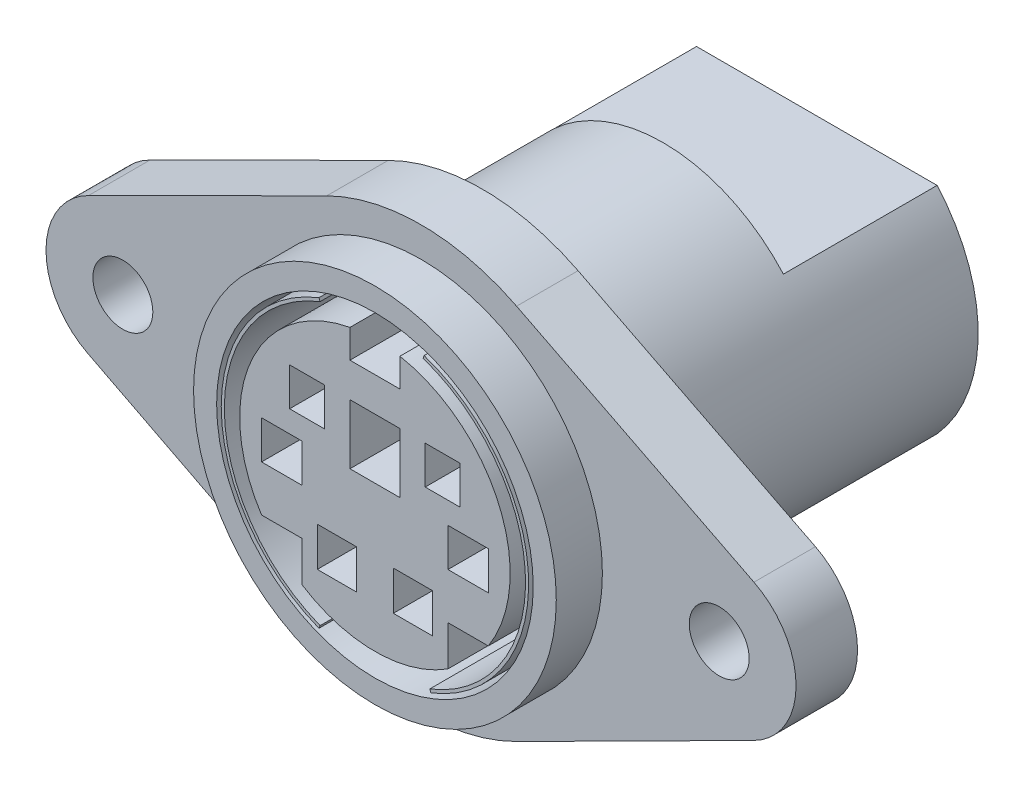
from build123d import *

# Parameters (mm, degrees)
SKETCH2_R           = 5.9944
BASE_EXTRUDE_DEPTH  = 1.524
BOSS_EXTRUDE1_DEPTH = 2.032
SKETCH4_R           = 0.9906
CUT_EXTRUDE1_DEPTH  = 15.37265507
SKETCH5_R           = 5.334
BOSS_EXTRUDE2_DEPTH = 11.049
CUT_EXTRUDE2_START  = -5.08
CUT_EXTRUDE2_DEPTH  = 5.08
SKETCH7_R           = 5.2324
CUT_EXTRUDE3_DEPTH  = 6.35
SKETCH8_R           = 4.4704
BOSS_EXTRUDE3_DEPTH = 6.35
CUT_EXTRUDE4_START  = -6.35
SKETCH10_W          = 1.651
SKETCH10_H          = 1.977343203
SKETCH10_W_2        = 1.157253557
SKETCH10_H_2        = 1.257746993
SKETCH10_W_3        = 1.333822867
SKETCH10_H_3        = 1.265813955
SKETCH10_W_4        = 1.2954
SKETCH10_H_4        = 1.2954
CUT_EXTRUDE4_DEPTH  = 6.35
BOSS_EXTRUDE4_DEPTH = 6.35


with BuildPart() as part:
    # Sketch2 → Base-Extrude (new body)
    with BuildSketch(Plane.XY):
        with Locations(Location((0, 0, 0), (0, 0, 180))):
            Circle(SKETCH2_R)
    extrude(amount=BASE_EXTRUDE_DEPTH)

    # Sketch3 → Boss-Extrude1 (add)
    with BuildSketch(Plane(origin=(0, 0, 0), x_dir=(-1, 0, 0), z_dir=(0, 0, -1))):
        with BuildLine():
            Line((-3.158335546, 6.2301799), (-11.00371635, 2.253032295))
            ThreePointArc((-11.00371635, 2.253032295), (-12.395228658, -0.015706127), (-10.997971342, -2.280910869))
            Line((-10.997971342, -2.280910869), (-3.142536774, -6.238163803))
            ThreePointArc((-3.142536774, -6.238163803), (0.022589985, -6.984963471), (3.182820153, -6.217707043))
            Line((3.182820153, -6.217707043), (11.013112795, -2.209410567))
            ThreePointArc((11.013112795, -2.209410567), (12.395688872, 0.064865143), (10.989387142, 2.324546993))
            Line((10.989387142, 2.324546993), (3.117574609, 6.250676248))
            ThreePointArc((3.117574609, 6.250676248), (-0.022812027, 6.984962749), (-3.158335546, 6.2301799))
        make_face()
    extrude(amount=BOSS_EXTRUDE1_DEPTH)

    # Sketch4 → Cut-Extrude1 (cut, through all)
    with BuildSketch(Plane.XY):
        with Locations((9.855230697, -0.012487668)):
            Circle(SKETCH4_R)
        with Locations((-9.855723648, 0.051573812)):
            Circle(SKETCH4_R)
    extrude(amount=-CUT_EXTRUDE1_DEPTH, mode=Mode.SUBTRACT)

    # Sketch5 → Boss-Extrude2 (add)
    with BuildSketch(Plane(origin=(0, 0, -2.032), x_dir=(-1, 0, 0), z_dir=(0, 0, -1))):
        Circle(SKETCH5_R)
    extrude(amount=BOSS_EXTRUDE2_DEPTH)

    # Sketch6 → Cut-Extrude2 (cut)
    with BuildSketch(Plane(origin=(0, 0, -13.081), x_dir=(-1, 0, 0), z_dir=(0, 0, -1)).offset(CUT_EXTRUDE2_START)):
        with BuildLine():
            Line((3.975728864, 3.556), (-3.975728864, 3.556))
            ThreePointArc((-3.975728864, 3.556), (0, 5.334), (3.975728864, 3.556))
        make_face()
        with BuildLine():
            Line((-3.975728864, -3.556), (3.975728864, -3.556))
            ThreePointArc((3.975728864, -3.556), (0, -5.334), (-3.975728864, -3.556))
        make_face()
    extrude(amount=CUT_EXTRUDE2_DEPTH, mode=Mode.SUBTRACT)

    # Sketch7 → Cut-Extrude3 (cut)
    with BuildSketch(Plane.XY.offset(1.524)):
        Circle(SKETCH7_R)
    extrude(amount=-CUT_EXTRUDE3_DEPTH, mode=Mode.SUBTRACT)

    # Sketch8 → Boss-Extrude3 (add)
    with BuildSketch(Plane.XY.offset(-4.826)):
        Circle(SKETCH8_R)
    extrude(amount=BOSS_EXTRUDE3_DEPTH)

    # Sketch10 → Cut-Extrude4 (cut)
    with BuildSketch(Plane.XY.offset(1.524).offset(CUT_EXTRUDE4_START)):
        with BuildLine():
            Line((-0.8255, 4.393520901), (-0.8255, 3.4544))
            Line((-0.8255, 3.4544), (0.8255, 3.4544))
            Line((0.8255, 3.4544), (0.8255, 4.393520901))
            ThreePointArc((0.8255, 4.393520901), (0, 4.4704), (-0.8255, 4.393520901))
        make_face()
        with Locations((0, 1.335875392)):
            Rectangle(SKETCH10_W, SKETCH10_H)
        with BuildLine():
            Line((2.413, -2.4384), (2.413, -3.763230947))
            ThreePointArc((2.413, -3.763230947), (3.150341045, -3.171723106), (3.746822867, -2.4384))
            Line((3.746822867, -2.4384), (2.413, -2.4384))
        make_face()
        with BuildLine():
            Line((-2.413, -2.4384), (-2.413, -3.763230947))
            ThreePointArc((-2.413, -3.763230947), (-3.150341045, -3.171723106), (-3.746822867, -2.4384))
            Line((-3.746822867, -2.4384), (-2.413, -2.4384))
        make_face()
        with Locations((-2.240773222, 1.695673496)):
            Rectangle(SKETCH10_W_2, SKETCH10_H_2)
        with Locations((2.240773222, 1.695673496)):
            Rectangle(SKETCH10_W_2, SKETCH10_H_2)
        with Locations((-3.079911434, -0.285703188)):
            Rectangle(SKETCH10_W_3, SKETCH10_H_3)
        with Locations((3.079911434, -0.285703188)):
            Rectangle(SKETCH10_W_3, SKETCH10_H_3)
        with Locations((-1.2573, -2.4257)):
            Rectangle(SKETCH10_W_4, SKETCH10_H_4)
        with Locations((1.2573, -2.4257)):
            Rectangle(SKETCH10_W_4, SKETCH10_H_4)
    extrude(amount=CUT_EXTRUDE4_DEPTH, mode=Mode.SUBTRACT)

    # Sketch12 → Boss-Extrude4 (add)
    with BuildSketch(Plane.XY.offset(-4.826)):
        with BuildLine():
            Line((1.591955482, 4.717005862), (1.62444437, 4.813271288))
            ThreePointArc((1.62444437, 4.813271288), (5.078588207, 0.119757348), (1.849514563, -4.731352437))
            Line((1.849514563, -4.731352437), (1.812524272, -4.636725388))
            ThreePointArc((1.812524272, -4.636725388), (4.977016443, 0.117362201), (1.591955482, 4.717005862))
        make_face()
        with BuildLine():
            Line((-1.812524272, 4.636725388), (-1.849514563, 4.731352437))
            ThreePointArc((-1.849514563, 4.731352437), (-5.08, 0), (-1.849514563, -4.731352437))
            Line((-1.849514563, -4.731352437), (-1.812524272, -4.636725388))
            ThreePointArc((-1.812524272, -4.636725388), (-4.9784, 0), (-1.812524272, 4.636725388))
        make_face()
    extrude(amount=BOSS_EXTRUDE4_DEPTH)


solid = part.part
